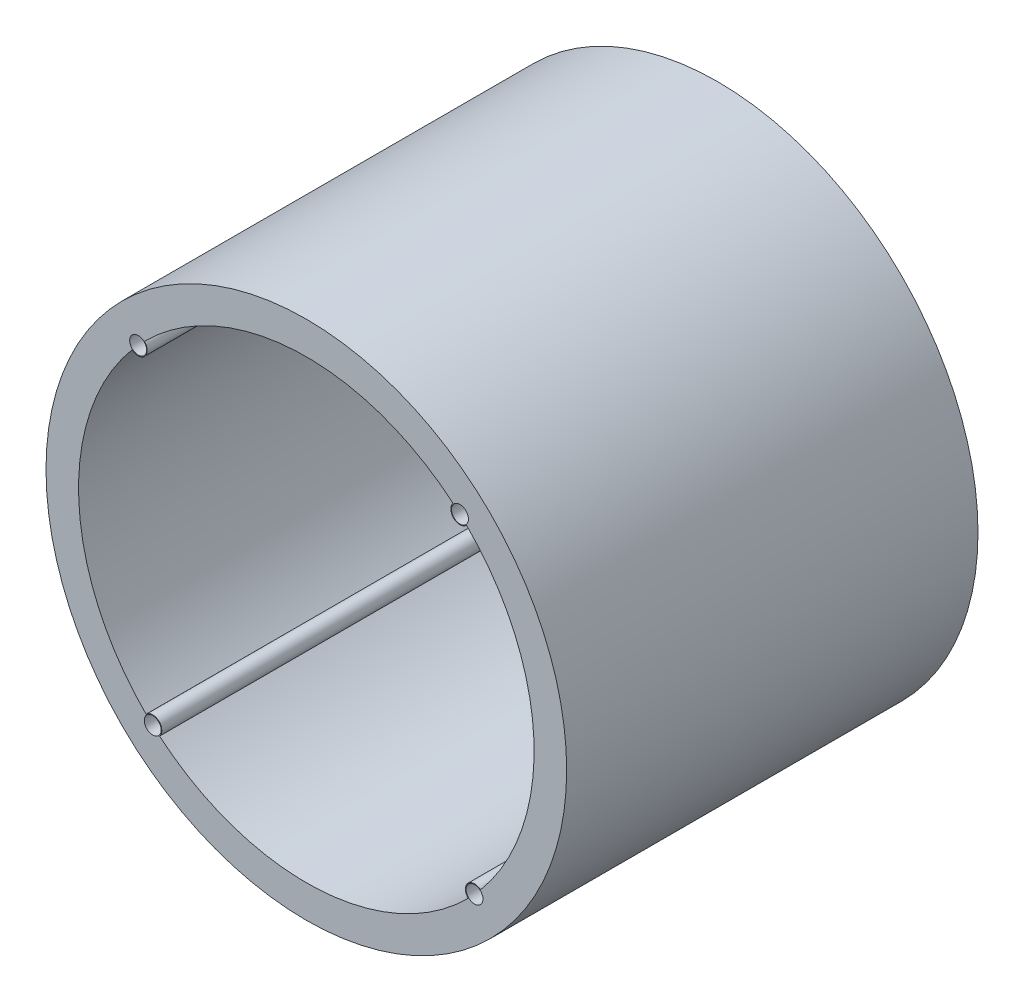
from build123d import *

# Parameters (mm, degrees)
SKETCH1_R            = 50.8
BOSS_EXTRUDE3_DEPTH  = 80.264
SKETCH6_R            = 44.45
CUT_EXTRUDE2_DEPTH   = 80.264
SKETCH7_R            = 1.778
BOSS_EXTRUDE9_DEPTH  = 80.264
SKETCH12_R           = 1.778
BOSS_EXTRUDE10_DEPTH = 80.264
SKETCH13_R           = 1.778
BOSS_EXTRUDE11_DEPTH = 80.264
SKETCH14_R           = 1.778
BOSS_EXTRUDE12_DEPTH = 80.264
SKETCH15_R           = 1.651
CUT_EXTRUDE5_DEPTH   = 80.264
SKETCH16_R           = 1.651
CUT_EXTRUDE6_DEPTH   = 80.264
SKETCH17_R           = 1.651
CUT_EXTRUDE7_DEPTH   = 80.264
SKETCH18_R           = 1.651
CUT_EXTRUDE8_DEPTH   = 80.264


with BuildPart() as part:
    # Sketch1 → Boss-Extrude3 (new body)
    with BuildSketch(Plane.XY):
        Circle(SKETCH1_R)
    extrude(amount=BOSS_EXTRUDE3_DEPTH)

    # Sketch6 → Cut-Extrude2 (cut)
    with BuildSketch(Plane.XY.offset(80.264)):
        Circle(SKETCH6_R)
    extrude(amount=-CUT_EXTRUDE2_DEPTH, mode=Mode.SUBTRACT)

    # Sketch7 → Boss-Extrude9 (add)
    with BuildSketch(Plane.XY.offset(80.264)):
        with Locations((29.9784696, 32.819108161)):
            Circle(SKETCH7_R)
    extrude(amount=-BOSS_EXTRUDE9_DEPTH)

    # Sketch12 → Boss-Extrude10 (add)
    with BuildSketch(Plane.XY.offset(80.264)):
        with Locations((-29.9784696, -32.819108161)):
            Circle(SKETCH12_R)
    extrude(amount=-BOSS_EXTRUDE10_DEPTH)

    # Sketch13 → Boss-Extrude11 (add)
    with BuildSketch(Plane.XY.offset(80.264)):
        with Locations((-32.819108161, 29.9784696)):
            Circle(SKETCH13_R)
    extrude(amount=-BOSS_EXTRUDE11_DEPTH)

    # Sketch14 → Boss-Extrude12 (add)
    with BuildSketch(Plane.XY.offset(80.264)):
        with Locations((32.819108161, -29.9784696)):
            Circle(SKETCH14_R)
    extrude(amount=-BOSS_EXTRUDE12_DEPTH)

    # Sketch15 → Cut-Extrude5 (cut)
    with BuildSketch(Plane.XY.offset(80.264)):
        with Locations((29.9784696, 32.819108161)):
            Circle(SKETCH15_R)
    extrude(amount=-CUT_EXTRUDE5_DEPTH, mode=Mode.SUBTRACT)

    # Sketch16 → Cut-Extrude6 (cut)
    with BuildSketch(Plane.XY.offset(80.264)):
        with Locations((-32.819108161, 29.9784696)):
            Circle(SKETCH16_R)
    extrude(amount=-CUT_EXTRUDE6_DEPTH, mode=Mode.SUBTRACT)

    # Sketch17 → Cut-Extrude7 (cut)
    with BuildSketch(Plane.XY.offset(80.264)):
        with Locations((-29.9784696, -32.819108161)):
            Circle(SKETCH17_R)
    extrude(amount=-CUT_EXTRUDE7_DEPTH, mode=Mode.SUBTRACT)

    # Sketch18 → Cut-Extrude8 (cut)
    with BuildSketch(Plane.XY.offset(80.264)):
        with Locations((32.819108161, -29.9784696)):
            Circle(SKETCH18_R)
    extrude(amount=-CUT_EXTRUDE8_DEPTH, mode=Mode.SUBTRACT)


solid = part.part
